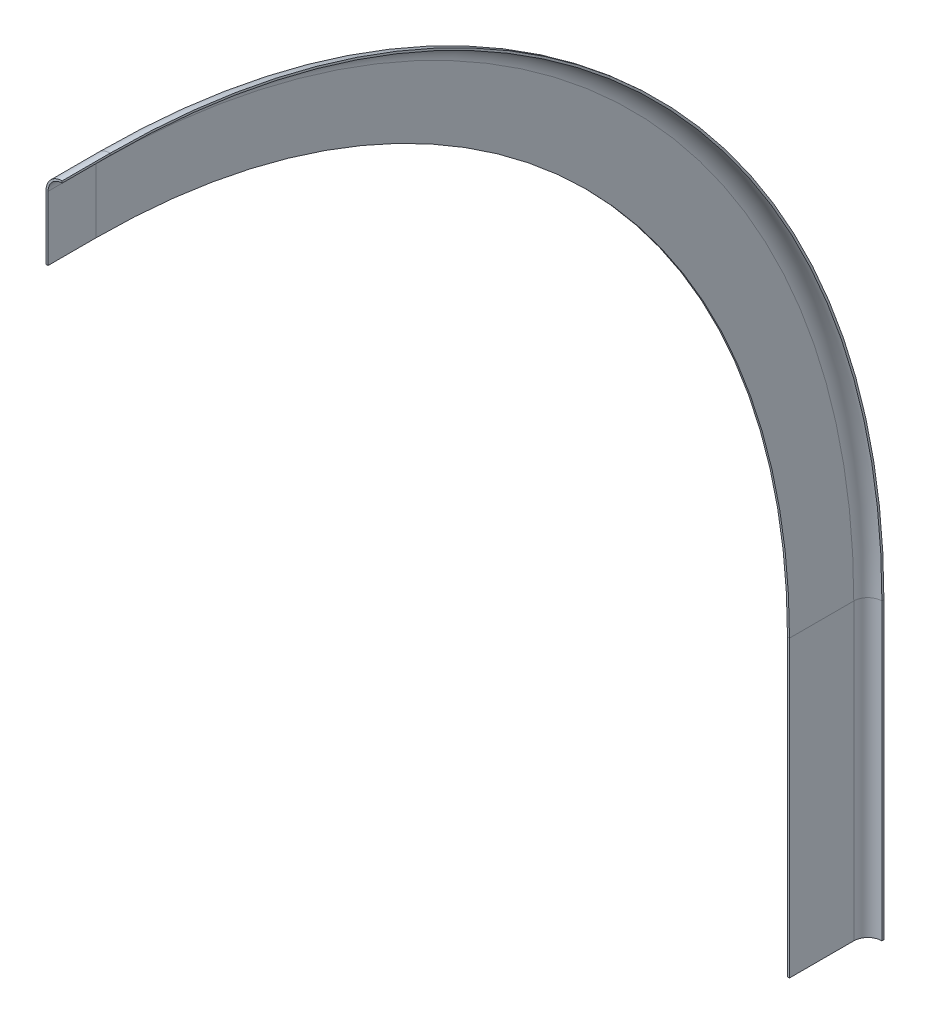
ISO-10303-21;
HEADER;
FILE_DESCRIPTION(('STEP AP214'),'2;1');
FILE_NAME('part.step','',(''),(''),'','','');
FILE_SCHEMA(('AUTOMOTIVE_DESIGN { 1 0 10303 214 1 1 1 1 }'));
ENDSEC;
DATA;
#1=APPLICATION_CONTEXT('core data for automotive mechanical design processes');
#2=APPLICATION_PROTOCOL_DEFINITION('international standard','automotive_design',2000,#1);
#3=PRODUCT_CONTEXT('',#1,'mechanical');
#4=PRODUCT('Part','Part','',(#3));
#5=PRODUCT_RELATED_PRODUCT_CATEGORY('part','',(#4));
#6=PRODUCT_DEFINITION_FORMATION('','',#4);
#7=PRODUCT_DEFINITION_CONTEXT('part definition',#1,'design');
#8=PRODUCT_DEFINITION('design','',#6,#7);
#9=PRODUCT_DEFINITION_SHAPE('','',#8);
#10=(LENGTH_UNIT() NAMED_UNIT(*) SI_UNIT(.MILLI.,.METRE.));
#11=(NAMED_UNIT(*) PLANE_ANGLE_UNIT() SI_UNIT($,.RADIAN.));
#12=(NAMED_UNIT(*) SI_UNIT($,.STERADIAN.) SOLID_ANGLE_UNIT());
#13=UNCERTAINTY_MEASURE_WITH_UNIT(LENGTH_MEASURE(1.E-05),#10,'distance_accuracy_value','');
#14=(GEOMETRIC_REPRESENTATION_CONTEXT(3) GLOBAL_UNCERTAINTY_ASSIGNED_CONTEXT((#13)) GLOBAL_UNIT_ASSIGNED_CONTEXT((#10,
#11,#12)) REPRESENTATION_CONTEXT('',''));
#15=CARTESIAN_POINT('',(0.,0.,0.));
#16=DIRECTION('',(0.,0.,1.));
#17=DIRECTION('',(1.,0.,0.));
#18=AXIS2_PLACEMENT_3D('',#15,#16,#17);
#19=CARTESIAN_POINT('',(-92.7099999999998,-844.7111,-623.1125));
#20=DIRECTION('',(0.,1.,0.));
#21=DIRECTION('',(0.,0.,1.));
#22=AXIS2_PLACEMENT_3D('',#19,#20,#21);
#23=PLANE('',#22);
#24=CARTESIAN_POINT('',(-92.7099999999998,-844.7111,-623.1125));
#25=DIRECTION('',(0.,1.,0.));
#26=DIRECTION('',(0.,0.,1.));
#27=AXIS2_PLACEMENT_3D('',#24,#25,#26);
#28=CIRCLE('',#27,25.4);
#29=CARTESIAN_POINT('',(-92.7099999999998,-844.7111,-648.5125));
#30=VERTEX_POINT('',#29);
#31=CARTESIAN_POINT('',(-118.11,-844.7111,-623.1125));
#32=VERTEX_POINT('',#31);
#33=EDGE_CURVE('E193',#30,#32,#28,.T.);
#34=ORIENTED_EDGE('',*,*,#33,.F.);
#35=DIRECTION('',(0.,0.,-1.));
#36=VECTOR('',#35,1.);
#37=CARTESIAN_POINT('',(-92.7099999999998,-844.7111,-645.3375));
#38=LINE('',#37,#36);
#39=CARTESIAN_POINT('',(-92.7099999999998,-844.7111,-645.3375));
#40=VERTEX_POINT('',#39);
#41=EDGE_CURVE('E236',#40,#30,#38,.T.);
#42=ORIENTED_EDGE('',*,*,#41,.F.);
#43=CARTESIAN_POINT('',(-92.7099999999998,-844.7111,-623.1125));
#44=DIRECTION('',(0.,-1.,0.));
#45=DIRECTION('',(0.,0.,1.));
#46=AXIS2_PLACEMENT_3D('',#43,#44,#45);
#47=CIRCLE('',#46,22.225);
#48=CARTESIAN_POINT('',(-114.935,-844.7111,-623.1125));
#49=VERTEX_POINT('',#48);
#50=EDGE_CURVE('E223',#49,#40,#47,.T.);
#51=ORIENTED_EDGE('',*,*,#50,.F.);
#52=DIRECTION('',(0.,0.,-1.));
#53=VECTOR('',#52,1.);
#54=CARTESIAN_POINT('',(-114.935,-844.7111,-623.1125));
#55=LINE('',#54,#53);
#56=CARTESIAN_POINT('',(-114.935,-844.7111,-521.5125));
#57=VERTEX_POINT('',#56);
#58=EDGE_CURVE('E146',#57,#49,#55,.T.);
#59=ORIENTED_EDGE('',*,*,#58,.F.);
#60=DIRECTION('',(1.,0.,0.));
#61=VECTOR('',#60,1.);
#62=CARTESIAN_POINT('',(-114.935,-844.7111,-521.5125));
#63=LINE('',#62,#61);
#64=CARTESIAN_POINT('',(-118.11,-844.7111,-521.5125));
#65=VERTEX_POINT('',#64);
#66=EDGE_CURVE('E150',#65,#57,#63,.T.);
#67=ORIENTED_EDGE('',*,*,#66,.F.);
#68=DIRECTION('',(0.,0.,1.));
#69=VECTOR('',#68,1.);
#70=CARTESIAN_POINT('',(-118.11,-844.7111,-623.1125));
#71=LINE('',#70,#69);
#72=EDGE_CURVE('E154',#32,#65,#71,.T.);
#73=ORIENTED_EDGE('',*,*,#72,.F.);
#74=EDGE_LOOP('',(#34,#42,#51,#59,#67,#73));
#75=FACE_BOUND('',#74,.T.);
#76=ADVANCED_FACE('F44',(#75),#23,.F.);
#77=CARTESIAN_POINT('',(-92.7099999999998,817.7236,650.1));
#78=DIRECTION('',(0.,0.,1.));
#79=DIRECTION('',(0.,-1.,0.));
#80=AXIS2_PLACEMENT_3D('',#77,#78,#79);
#81=PLANE('',#80);
#82=CARTESIAN_POINT('',(-92.7099999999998,817.7236,650.1));
#83=DIRECTION('',(0.,0.,1.));
#84=DIRECTION('',(0.,-1.,0.));
#85=AXIS2_PLACEMENT_3D('',#82,#83,#84);
#86=CIRCLE('',#85,25.4);
#87=CARTESIAN_POINT('',(-92.7099999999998,843.1236,650.1));
#88=VERTEX_POINT('',#87);
#89=CARTESIAN_POINT('',(-118.11,817.7236,650.1));
#90=VERTEX_POINT('',#89);
#91=EDGE_CURVE('E168',#88,#90,#86,.T.);
#92=ORIENTED_EDGE('',*,*,#91,.T.);
#93=DIRECTION('',(0.,-1.,0.));
#94=VECTOR('',#93,1.);
#95=CARTESIAN_POINT('',(-118.11,817.7236,650.1));
#96=LINE('',#95,#94);
#97=CARTESIAN_POINT('',(-118.11,716.1236,650.1));
#98=VERTEX_POINT('',#97);
#99=EDGE_CURVE('E169',#90,#98,#96,.T.);
#100=ORIENTED_EDGE('',*,*,#99,.T.);
#101=DIRECTION('',(1.,0.,0.));
#102=VECTOR('',#101,1.);
#103=CARTESIAN_POINT('',(-114.935,716.1236,650.1));
#104=LINE('',#103,#102);
#105=CARTESIAN_POINT('',(-114.935,716.1236,650.1));
#106=VERTEX_POINT('',#105);
#107=EDGE_CURVE('E209',#98,#106,#104,.T.);
#108=ORIENTED_EDGE('',*,*,#107,.T.);
#109=DIRECTION('',(0.,1.,0.));
#110=VECTOR('',#109,1.);
#111=CARTESIAN_POINT('',(-114.935,817.7236,650.1));
#112=LINE('',#111,#110);
#113=CARTESIAN_POINT('',(-114.935,817.7236,650.1));
#114=VERTEX_POINT('',#113);
#115=EDGE_CURVE('E63',#106,#114,#112,.T.);
#116=ORIENTED_EDGE('',*,*,#115,.T.);
#117=CARTESIAN_POINT('',(-92.7099999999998,817.7236,650.1));
#118=DIRECTION('',(0.,0.,-1.));
#119=DIRECTION('',(0.,-1.,0.));
#120=AXIS2_PLACEMENT_3D('',#117,#118,#119);
#121=CIRCLE('',#120,22.225);
#122=CARTESIAN_POINT('',(-92.7099999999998,839.9486,650.1));
#123=VERTEX_POINT('',#122);
#124=EDGE_CURVE('E59',#114,#123,#121,.T.);
#125=ORIENTED_EDGE('',*,*,#124,.T.);
#126=DIRECTION('',(0.,1.,0.));
#127=VECTOR('',#126,1.);
#128=CARTESIAN_POINT('',(-92.7099999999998,839.9486,650.1));
#129=LINE('',#128,#127);
#130=EDGE_CURVE('E11',#123,#88,#129,.T.);
#131=ORIENTED_EDGE('',*,*,#130,.T.);
#132=EDGE_LOOP('',(#92,#100,#108,#116,#125,#131));
#133=FACE_BOUND('',#132,.T.);
#134=ADVANCED_FACE('F166',(#133),#81,.T.);
#135=CARTESIAN_POINT('',(-92.7099999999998,-844.7111,-623.1125));
#136=DIRECTION('',(0.,1.,0.));
#137=DIRECTION('',(0.,0.,1.));
#138=AXIS2_PLACEMENT_3D('',#135,#136,#137);
#139=CYLINDRICAL_SURFACE('',#138,25.4);
#140=DIRECTION('',(0.,1.,0.));
#141=VECTOR('',#140,1.);
#142=CARTESIAN_POINT('',(-118.11,-844.7111,-623.1125));
#143=LINE('',#142,#141);
#144=CARTESIAN_POINT('',(-118.11,-379.5689,-623.1125));
#145=VERTEX_POINT('',#144);
#146=EDGE_CURVE('E198',#32,#145,#143,.T.);
#147=ORIENTED_EDGE('',*,*,#146,.T.);
#148=CARTESIAN_POINT('',(-92.7099999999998,-379.5689,-623.1125));
#149=DIRECTION('',(0.,1.,0.));
#150=DIRECTION('',(0.,0.,1.));
#151=AXIS2_PLACEMENT_3D('',#148,#149,#150);
#152=CIRCLE('',#151,25.4);
#153=CARTESIAN_POINT('',(-92.7099999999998,-379.5689,-648.5125));
#154=VERTEX_POINT('',#153);
#155=EDGE_CURVE('E268',#154,#145,#152,.T.);
#156=ORIENTED_EDGE('',*,*,#155,.F.);
#157=DIRECTION('',(0.,1.,0.));
#158=VECTOR('',#157,1.);
#159=CARTESIAN_POINT('',(-92.7099999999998,-844.7111,-648.5125));
#160=LINE('',#159,#158);
#161=EDGE_CURVE('E249',#30,#154,#160,.T.);
#162=ORIENTED_EDGE('',*,*,#161,.F.);
#163=ORIENTED_EDGE('',*,*,#33,.T.);
#164=EDGE_LOOP('',(#147,#156,#162,#163));
#165=FACE_BOUND('',#164,.T.);
#166=ADVANCED_FACE('F273',(#165),#139,.T.);
#167=CARTESIAN_POINT('',(-118.11,-844.7111,-623.1125));
#168=DIRECTION('',(-1.,0.,0.));
#169=DIRECTION('',(0.,0.,1.));
#170=AXIS2_PLACEMENT_3D('',#167,#168,#169);
#171=PLANE('',#170);
#172=DIRECTION('',(0.,1.,0.));
#173=VECTOR('',#172,1.);
#174=CARTESIAN_POINT('',(-118.11,-844.7111,-521.5125));
#175=LINE('',#174,#173);
#176=CARTESIAN_POINT('',(-118.11,-379.5689,-521.5125));
#177=VERTEX_POINT('',#176);
#178=EDGE_CURVE('E197',#65,#177,#175,.T.);
#179=ORIENTED_EDGE('',*,*,#178,.T.);
#180=DIRECTION('',(0.,0.,1.));
#181=VECTOR('',#180,1.);
#182=CARTESIAN_POINT('',(-118.11,-379.5689,-623.1125));
#183=LINE('',#182,#181);
#184=EDGE_CURVE('E195',#145,#177,#183,.T.);
#185=ORIENTED_EDGE('',*,*,#184,.F.);
#186=ORIENTED_EDGE('',*,*,#146,.F.);
#187=ORIENTED_EDGE('',*,*,#72,.T.);
#188=EDGE_LOOP('',(#179,#185,#186,#187));
#189=FACE_BOUND('',#188,.T.);
#190=ADVANCED_FACE('F279',(#189),#171,.T.);
#191=CARTESIAN_POINT('',(-114.935,-844.7111,-521.5125));
#192=DIRECTION('',(0.,0.,1.));
#193=DIRECTION('',(0.,-1.,0.));
#194=AXIS2_PLACEMENT_3D('',#191,#192,#193);
#195=PLANE('',#194);
#196=DIRECTION('',(0.,1.,0.));
#197=VECTOR('',#196,1.);
#198=CARTESIAN_POINT('',(-114.935,-844.7111,-521.5125));
#199=LINE('',#198,#197);
#200=CARTESIAN_POINT('',(-114.935,-379.5689,-521.5125));
#201=VERTEX_POINT('',#200);
#202=EDGE_CURVE('E212',#57,#201,#199,.T.);
#203=ORIENTED_EDGE('',*,*,#202,.T.);
#204=DIRECTION('',(1.,0.,0.));
#205=VECTOR('',#204,1.);
#206=CARTESIAN_POINT('',(-114.935,-379.5689,-521.5125));
#207=LINE('',#206,#205);
#208=EDGE_CURVE('E205',#177,#201,#207,.T.);
#209=ORIENTED_EDGE('',*,*,#208,.F.);
#210=ORIENTED_EDGE('',*,*,#178,.F.);
#211=ORIENTED_EDGE('',*,*,#66,.T.);
#212=EDGE_LOOP('',(#203,#209,#210,#211));
#213=FACE_BOUND('',#212,.T.);
#214=ADVANCED_FACE('F333',(#213),#195,.T.);
#215=CARTESIAN_POINT('',(-114.935,-844.7111,-623.1125));
#216=DIRECTION('',(1.,0.,0.));
#217=DIRECTION('',(0.,0.,-1.));
#218=AXIS2_PLACEMENT_3D('',#215,#216,#217);
#219=PLANE('',#218);
#220=DIRECTION('',(0.,1.,0.));
#221=VECTOR('',#220,1.);
#222=CARTESIAN_POINT('',(-114.935,-844.7111,-623.1125));
#223=LINE('',#222,#221);
#224=CARTESIAN_POINT('',(-114.935,-379.5689,-623.1125));
#225=VERTEX_POINT('',#224);
#226=EDGE_CURVE('E224',#49,#225,#223,.T.);
#227=ORIENTED_EDGE('',*,*,#226,.T.);
#228=DIRECTION('',(0.,0.,-1.));
#229=VECTOR('',#228,1.);
#230=CARTESIAN_POINT('',(-114.935,-379.5689,-623.1125));
#231=LINE('',#230,#229);
#232=EDGE_CURVE('E215',#201,#225,#231,.T.);
#233=ORIENTED_EDGE('',*,*,#232,.F.);
#234=ORIENTED_EDGE('',*,*,#202,.F.);
#235=ORIENTED_EDGE('',*,*,#58,.T.);
#236=EDGE_LOOP('',(#227,#233,#234,#235));
#237=FACE_BOUND('',#236,.T.);
#238=ADVANCED_FACE('F341',(#237),#219,.T.);
#239=CARTESIAN_POINT('',(-92.7099999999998,-844.7111,-623.1125));
#240=DIRECTION('',(0.,1.,0.));
#241=DIRECTION('',(0.,0.,1.));
#242=AXIS2_PLACEMENT_3D('',#239,#240,#241);
#243=CYLINDRICAL_SURFACE('',#242,22.225);
#244=DIRECTION('',(0.,1.,0.));
#245=VECTOR('',#244,1.);
#246=CARTESIAN_POINT('',(-92.7099999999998,-844.7111,-645.3375));
#247=LINE('',#246,#245);
#248=CARTESIAN_POINT('',(-92.7099999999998,-379.5689,-645.3375));
#249=VERTEX_POINT('',#248);
#250=EDGE_CURVE('E238',#40,#249,#247,.T.);
#251=ORIENTED_EDGE('',*,*,#250,.T.);
#252=CARTESIAN_POINT('',(-92.7099999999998,-379.5689,-623.1125));
#253=DIRECTION('',(0.,-1.,0.));
#254=DIRECTION('',(0.,0.,1.));
#255=AXIS2_PLACEMENT_3D('',#252,#253,#254);
#256=CIRCLE('',#255,22.225);
#257=EDGE_CURVE('E226',#225,#249,#256,.T.);
#258=ORIENTED_EDGE('',*,*,#257,.F.);
#259=ORIENTED_EDGE('',*,*,#226,.F.);
#260=ORIENTED_EDGE('',*,*,#50,.T.);
#261=EDGE_LOOP('',(#251,#258,#259,#260));
#262=FACE_BOUND('',#261,.T.);
#263=ADVANCED_FACE('F351',(#262),#243,.F.);
#264=CARTESIAN_POINT('',(-92.7099999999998,-844.7111,-645.3375));
#265=DIRECTION('',(1.,0.,0.));
#266=DIRECTION('',(0.,0.,-1.));
#267=AXIS2_PLACEMENT_3D('',#264,#265,#266);
#268=PLANE('',#267);
#269=DIRECTION('',(0.,0.,-1.));
#270=VECTOR('',#269,1.);
#271=CARTESIAN_POINT('',(-92.7099999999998,-379.5689,-645.3375));
#272=LINE('',#271,#270);
#273=EDGE_CURVE('E241',#249,#154,#272,.T.);
#274=ORIENTED_EDGE('',*,*,#273,.F.);
#275=ORIENTED_EDGE('',*,*,#250,.F.);
#276=ORIENTED_EDGE('',*,*,#41,.T.);
#277=ORIENTED_EDGE('',*,*,#161,.T.);
#278=EDGE_LOOP('',(#274,#275,#276,#277));
#279=FACE_BOUND('',#278,.T.);
#280=ADVANCED_FACE('F293',(#279),#268,.T.);
#281=CARTESIAN_POINT('',(-92.7099999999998,-379.5689,574.18));
#282=DIRECTION('',(1.,0.,0.));
#283=DIRECTION('',(0.,0.,-1.));
#284=AXIS2_PLACEMENT_3D('',#281,#282,#283);
#285=TOROIDAL_SURFACE('',#284,1197.2925,25.4);
#286=CARTESIAN_POINT('',(-118.11,-379.5689,574.18));
#287=DIRECTION('',(1.,0.,0.));
#288=DIRECTION('',(0.,0.,-1.));
#289=AXIS2_PLACEMENT_3D('',#286,#287,#288);
#290=CIRCLE('',#289,1197.2925);
#291=CARTESIAN_POINT('',(-118.11,817.7236,574.18));
#292=VERTEX_POINT('',#291);
#293=EDGE_CURVE('E204',#145,#292,#290,.T.);
#294=ORIENTED_EDGE('',*,*,#293,.T.);
#295=CARTESIAN_POINT('',(-92.7099999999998,817.7236,574.18));
#296=DIRECTION('',(0.,0.,1.));
#297=DIRECTION('',(0.,-1.,0.));
#298=AXIS2_PLACEMENT_3D('',#295,#296,#297);
#299=CIRCLE('',#298,25.4);
#300=CARTESIAN_POINT('',(-92.7099999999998,843.1236,574.18));
#301=VERTEX_POINT('',#300);
#302=EDGE_CURVE('E190',#301,#292,#299,.T.);
#303=ORIENTED_EDGE('',*,*,#302,.F.);
#304=CARTESIAN_POINT('',(-92.7099999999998,-379.5689,574.18));
#305=DIRECTION('',(1.,0.,0.));
#306=DIRECTION('',(0.,0.,-1.));
#307=AXIS2_PLACEMENT_3D('',#304,#305,#306);
#308=CIRCLE('',#307,1222.6925);
#309=EDGE_CURVE('E255',#154,#301,#308,.T.);
#310=ORIENTED_EDGE('',*,*,#309,.F.);
#311=ORIENTED_EDGE('',*,*,#155,.T.);
#312=EDGE_LOOP('',(#294,#303,#310,#311));
#313=FACE_BOUND('',#312,.T.);
#314=ADVANCED_FACE('F259',(#313),#285,.T.);
#315=CARTESIAN_POINT('',(-118.11,-379.5689,-623.1125));
#316=DIRECTION('',(-1.,0.,0.));
#317=DIRECTION('',(0.,0.,1.));
#318=AXIS2_PLACEMENT_3D('',#315,#316,#317);
#319=PLANE('',#318);
#320=CARTESIAN_POINT('',(-118.11,-379.5689,574.18));
#321=DIRECTION('',(1.,0.,0.));
#322=DIRECTION('',(0.,0.,-1.));
#323=AXIS2_PLACEMENT_3D('',#320,#321,#322);
#324=CIRCLE('',#323,1095.6925);
#325=CARTESIAN_POINT('',(-118.11,716.1236,574.18));
#326=VERTEX_POINT('',#325);
#327=EDGE_CURVE('E132',#177,#326,#324,.T.);
#328=ORIENTED_EDGE('',*,*,#327,.T.);
#329=DIRECTION('',(0.,-1.,0.));
#330=VECTOR('',#329,1.);
#331=CARTESIAN_POINT('',(-118.11,817.7236,574.18));
#332=LINE('',#331,#330);
#333=EDGE_CURVE('E203',#292,#326,#332,.T.);
#334=ORIENTED_EDGE('',*,*,#333,.F.);
#335=ORIENTED_EDGE('',*,*,#293,.F.);
#336=ORIENTED_EDGE('',*,*,#184,.T.);
#337=EDGE_LOOP('',(#328,#334,#335,#336));
#338=FACE_BOUND('',#337,.T.);
#339=ADVANCED_FACE('F281',(#338),#319,.T.);
#340=CARTESIAN_POINT('',(0.,-379.5689,574.18));
#341=DIRECTION('',(1.,0.,0.));
#342=DIRECTION('',(0.,0.,-1.));
#343=AXIS2_PLACEMENT_3D('',#340,#341,#342);
#344=CYLINDRICAL_SURFACE('',#343,1095.6925);
#345=CARTESIAN_POINT('',(-114.935,-379.5689,574.18));
#346=DIRECTION('',(1.,0.,0.));
#347=DIRECTION('',(0.,0.,-1.));
#348=AXIS2_PLACEMENT_3D('',#345,#346,#347);
#349=CIRCLE('',#348,1095.6925);
#350=CARTESIAN_POINT('',(-114.935,716.1236,574.18));
#351=VERTEX_POINT('',#350);
#352=EDGE_CURVE('E121',#201,#351,#349,.T.);
#353=ORIENTED_EDGE('',*,*,#352,.T.);
#354=DIRECTION('',(1.,0.,0.));
#355=VECTOR('',#354,1.);
#356=CARTESIAN_POINT('',(-114.935,716.1236,574.18));
#357=LINE('',#356,#355);
#358=EDGE_CURVE('E207',#326,#351,#357,.T.);
#359=ORIENTED_EDGE('',*,*,#358,.F.);
#360=ORIENTED_EDGE('',*,*,#327,.F.);
#361=ORIENTED_EDGE('',*,*,#208,.T.);
#362=EDGE_LOOP('',(#353,#359,#360,#361));
#363=FACE_BOUND('',#362,.T.);
#364=ADVANCED_FACE('F282',(#363),#344,.F.);
#365=CARTESIAN_POINT('',(-114.935,-379.5689,-623.1125));
#366=DIRECTION('',(1.,0.,0.));
#367=DIRECTION('',(0.,0.,-1.));
#368=AXIS2_PLACEMENT_3D('',#365,#366,#367);
#369=PLANE('',#368);
#370=CARTESIAN_POINT('',(-114.935,-379.5689,574.18));
#371=DIRECTION('',(1.,0.,0.));
#372=DIRECTION('',(0.,0.,-1.));
#373=AXIS2_PLACEMENT_3D('',#370,#371,#372);
#374=CIRCLE('',#373,1197.2925);
#375=CARTESIAN_POINT('',(-114.935,817.7236,574.18));
#376=VERTEX_POINT('',#375);
#377=EDGE_CURVE('E120',#225,#376,#374,.T.);
#378=ORIENTED_EDGE('',*,*,#377,.T.);
#379=DIRECTION('',(0.,1.,0.));
#380=VECTOR('',#379,1.);
#381=CARTESIAN_POINT('',(-114.935,817.7236,574.18));
#382=LINE('',#381,#380);
#383=EDGE_CURVE('E218',#351,#376,#382,.T.);
#384=ORIENTED_EDGE('',*,*,#383,.F.);
#385=ORIENTED_EDGE('',*,*,#352,.F.);
#386=ORIENTED_EDGE('',*,*,#232,.T.);
#387=EDGE_LOOP('',(#378,#384,#385,#386));
#388=FACE_BOUND('',#387,.T.);
#389=ADVANCED_FACE('F287',(#388),#369,.T.);
#390=CARTESIAN_POINT('',(-92.7099999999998,-379.5689,574.18));
#391=DIRECTION('',(1.,0.,0.));
#392=DIRECTION('',(0.,0.,-1.));
#393=AXIS2_PLACEMENT_3D('',#390,#391,#392);
#394=TOROIDAL_SURFACE('',#393,1197.2925,22.225);
#395=CARTESIAN_POINT('',(-92.7099999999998,-379.5689,574.18));
#396=DIRECTION('',(1.,0.,0.));
#397=DIRECTION('',(0.,0.,-1.));
#398=AXIS2_PLACEMENT_3D('',#395,#396,#397);
#399=CIRCLE('',#398,1219.5175);
#400=CARTESIAN_POINT('',(-92.7099999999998,839.9486,574.18));
#401=VERTEX_POINT('',#400);
#402=EDGE_CURVE('E243',#249,#401,#399,.T.);
#403=ORIENTED_EDGE('',*,*,#402,.T.);
#404=CARTESIAN_POINT('',(-92.7099999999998,817.7236,574.18));
#405=DIRECTION('',(0.,0.,-1.));
#406=DIRECTION('',(0.,-1.,0.));
#407=AXIS2_PLACEMENT_3D('',#404,#405,#406);
#408=CIRCLE('',#407,22.225);
#409=EDGE_CURVE('E233',#376,#401,#408,.T.);
#410=ORIENTED_EDGE('',*,*,#409,.F.);
#411=ORIENTED_EDGE('',*,*,#377,.F.);
#412=ORIENTED_EDGE('',*,*,#257,.T.);
#413=EDGE_LOOP('',(#403,#410,#411,#412));
#414=FACE_BOUND('',#413,.T.);
#415=ADVANCED_FACE('F393',(#414),#394,.F.);
#416=CARTESIAN_POINT('',(-92.7099999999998,-379.5689,-645.3375));
#417=DIRECTION('',(1.,0.,0.));
#418=DIRECTION('',(0.,0.,-1.));
#419=AXIS2_PLACEMENT_3D('',#416,#417,#418);
#420=PLANE('',#419);
#421=DIRECTION('',(0.,1.,0.));
#422=VECTOR('',#421,1.);
#423=CARTESIAN_POINT('',(-92.7099999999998,839.9486,574.18));
#424=LINE('',#423,#422);
#425=EDGE_CURVE('E192',#401,#301,#424,.T.);
#426=ORIENTED_EDGE('',*,*,#425,.F.);
#427=ORIENTED_EDGE('',*,*,#402,.F.);
#428=ORIENTED_EDGE('',*,*,#273,.T.);
#429=ORIENTED_EDGE('',*,*,#309,.T.);
#430=EDGE_LOOP('',(#426,#427,#428,#429));
#431=FACE_BOUND('',#430,.T.);
#432=ADVANCED_FACE('F261',(#431),#420,.T.);
#433=CARTESIAN_POINT('',(-92.7099999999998,817.7236,574.18));
#434=DIRECTION('',(0.,0.,1.));
#435=DIRECTION('',(1.,0.,0.));
#436=AXIS2_PLACEMENT_3D('',#433,#434,#435);
#437=CYLINDRICAL_SURFACE('',#436,25.4);
#438=DIRECTION('',(0.,0.,1.));
#439=VECTOR('',#438,1.);
#440=CARTESIAN_POINT('',(-118.11,817.7236,574.18));
#441=LINE('',#440,#439);
#442=EDGE_CURVE('E172',#292,#90,#441,.T.);
#443=ORIENTED_EDGE('',*,*,#442,.T.);
#444=ORIENTED_EDGE('',*,*,#91,.F.);
#445=DIRECTION('',(0.,0.,1.));
#446=VECTOR('',#445,1.);
#447=CARTESIAN_POINT('',(-92.7099999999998,843.1236,574.18));
#448=LINE('',#447,#446);
#449=EDGE_CURVE('E174',#301,#88,#448,.T.);
#450=ORIENTED_EDGE('',*,*,#449,.F.);
#451=ORIENTED_EDGE('',*,*,#302,.T.);
#452=EDGE_LOOP('',(#443,#444,#450,#451));
#453=FACE_BOUND('',#452,.T.);
#454=ADVANCED_FACE('F184',(#453),#437,.T.);
#455=CARTESIAN_POINT('',(-118.11,817.7236,574.18));
#456=DIRECTION('',(-1.,0.,0.));
#457=DIRECTION('',(0.,0.,1.));
#458=AXIS2_PLACEMENT_3D('',#455,#456,#457);
#459=PLANE('',#458);
#460=DIRECTION('',(0.,0.,1.));
#461=VECTOR('',#460,1.);
#462=CARTESIAN_POINT('',(-118.11,716.1236,574.18));
#463=LINE('',#462,#461);
#464=EDGE_CURVE('E185',#326,#98,#463,.T.);
#465=ORIENTED_EDGE('',*,*,#464,.T.);
#466=ORIENTED_EDGE('',*,*,#99,.F.);
#467=ORIENTED_EDGE('',*,*,#442,.F.);
#468=ORIENTED_EDGE('',*,*,#333,.T.);
#469=EDGE_LOOP('',(#465,#466,#467,#468));
#470=FACE_BOUND('',#469,.T.);
#471=ADVANCED_FACE('F177',(#470),#459,.T.);
#472=CARTESIAN_POINT('',(-114.935,716.1236,574.18));
#473=DIRECTION('',(0.,-1.,0.));
#474=DIRECTION('',(0.,0.,-1.));
#475=AXIS2_PLACEMENT_3D('',#472,#473,#474);
#476=PLANE('',#475);
#477=DIRECTION('',(0.,0.,1.));
#478=VECTOR('',#477,1.);
#479=CARTESIAN_POINT('',(-114.935,716.1236,574.18));
#480=LINE('',#479,#478);
#481=EDGE_CURVE('E105',#351,#106,#480,.T.);
#482=ORIENTED_EDGE('',*,*,#481,.T.);
#483=ORIENTED_EDGE('',*,*,#107,.F.);
#484=ORIENTED_EDGE('',*,*,#464,.F.);
#485=ORIENTED_EDGE('',*,*,#358,.T.);
#486=EDGE_LOOP('',(#482,#483,#484,#485));
#487=FACE_BOUND('',#486,.T.);
#488=ADVANCED_FACE('F428',(#487),#476,.T.);
#489=CARTESIAN_POINT('',(-114.935,817.7236,574.18));
#490=DIRECTION('',(1.,0.,0.));
#491=DIRECTION('',(0.,1.,0.));
#492=AXIS2_PLACEMENT_3D('',#489,#490,#491);
#493=PLANE('',#492);
#494=DIRECTION('',(0.,0.,1.));
#495=VECTOR('',#494,1.);
#496=CARTESIAN_POINT('',(-114.935,817.7236,574.18));
#497=LINE('',#496,#495);
#498=EDGE_CURVE('E92',#376,#114,#497,.T.);
#499=ORIENTED_EDGE('',*,*,#498,.T.);
#500=ORIENTED_EDGE('',*,*,#115,.F.);
#501=ORIENTED_EDGE('',*,*,#481,.F.);
#502=ORIENTED_EDGE('',*,*,#383,.T.);
#503=EDGE_LOOP('',(#499,#500,#501,#502));
#504=FACE_BOUND('',#503,.T.);
#505=ADVANCED_FACE('F301',(#504),#493,.T.);
#506=CARTESIAN_POINT('',(-92.7099999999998,817.7236,574.18));
#507=DIRECTION('',(0.,0.,1.));
#508=DIRECTION('',(1.,0.,0.));
#509=AXIS2_PLACEMENT_3D('',#506,#507,#508);
#510=CYLINDRICAL_SURFACE('',#509,22.225);
#511=DIRECTION('',(0.,0.,1.));
#512=VECTOR('',#511,1.);
#513=CARTESIAN_POINT('',(-92.7099999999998,839.9486,574.18));
#514=LINE('',#513,#512);
#515=EDGE_CURVE('E55',#401,#123,#514,.T.);
#516=ORIENTED_EDGE('',*,*,#515,.T.);
#517=ORIENTED_EDGE('',*,*,#124,.F.);
#518=ORIENTED_EDGE('',*,*,#498,.F.);
#519=ORIENTED_EDGE('',*,*,#409,.T.);
#520=EDGE_LOOP('',(#516,#517,#518,#519));
#521=FACE_BOUND('',#520,.T.);
#522=ADVANCED_FACE('F298',(#521),#510,.F.);
#523=CARTESIAN_POINT('',(-92.7099999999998,839.9486,574.18));
#524=DIRECTION('',(1.,0.,0.));
#525=DIRECTION('',(0.,0.,-1.));
#526=AXIS2_PLACEMENT_3D('',#523,#524,#525);
#527=PLANE('',#526);
#528=ORIENTED_EDGE('',*,*,#130,.F.);
#529=ORIENTED_EDGE('',*,*,#515,.F.);
#530=ORIENTED_EDGE('',*,*,#425,.T.);
#531=ORIENTED_EDGE('',*,*,#449,.T.);
#532=EDGE_LOOP('',(#528,#529,#530,#531));
#533=FACE_BOUND('',#532,.T.);
#534=ADVANCED_FACE('F254',(#533),#527,.T.);
#535=CLOSED_SHELL('',(#76,#134,#166,#190,#214,#238,#263,#280,#314,#339,#364,#389,#415,#432,#454,
#471,#488,#505,#522,#534));
#536=MANIFOLD_SOLID_BREP('B2',#535);
#537=ADVANCED_BREP_SHAPE_REPRESENTATION('',(#18,#536),#14);
#538=SHAPE_DEFINITION_REPRESENTATION(#9,#537);
ENDSEC;
END-ISO-10303-21;
